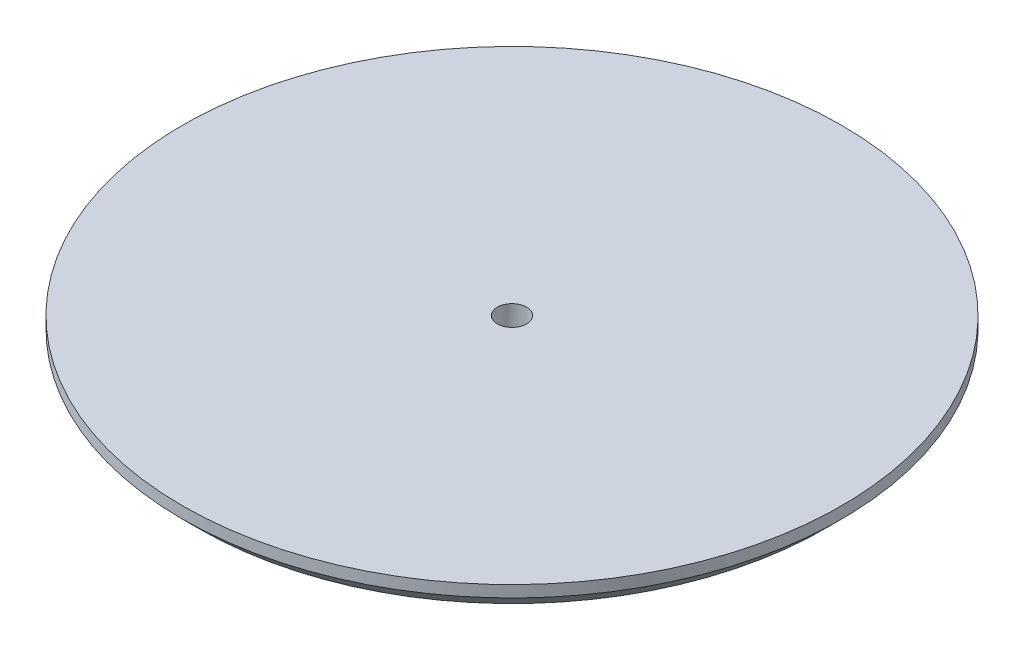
from build123d import *

# Parameters (mm, degrees)
ESQUISSE2_R             = 3.1
ENL_V_MAT_EXTRU_1_DEPTH = 100.176610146


with BuildPart() as part:
    # Esquisse1 → R_volution1 (revolve)
    with BuildSketch(Plane.XY, mode=Mode.PRIVATE) as r_volution1_sk:
        Polygon((35, 6), (0, 6), (0, 0), (31.464466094, 0), (66.464466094, 0), (70, 3.535533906), (70, 6), align=None)
    revolve(r_volution1_sk.sketch.rotate(Axis((0, 18.075916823, 0), (0, -1, 0)), 90), axis=Axis((0, 18.075916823, 0), (0, -1, 0)))

    # Esquisse2 → Enl_v. mat.-Extru.1 (cut, through all)
    with BuildSketch(Plane(origin=(0, 6, 0), x_dir=(-1, 0, 0), z_dir=(0, 1, 0))):
        with Locations(Location((0, 0, 0), (0, 0, 90))):
            Circle(ESQUISSE2_R)
    extrude(amount=-ENL_V_MAT_EXTRU_1_DEPTH, mode=Mode.SUBTRACT)


solid = part.part
